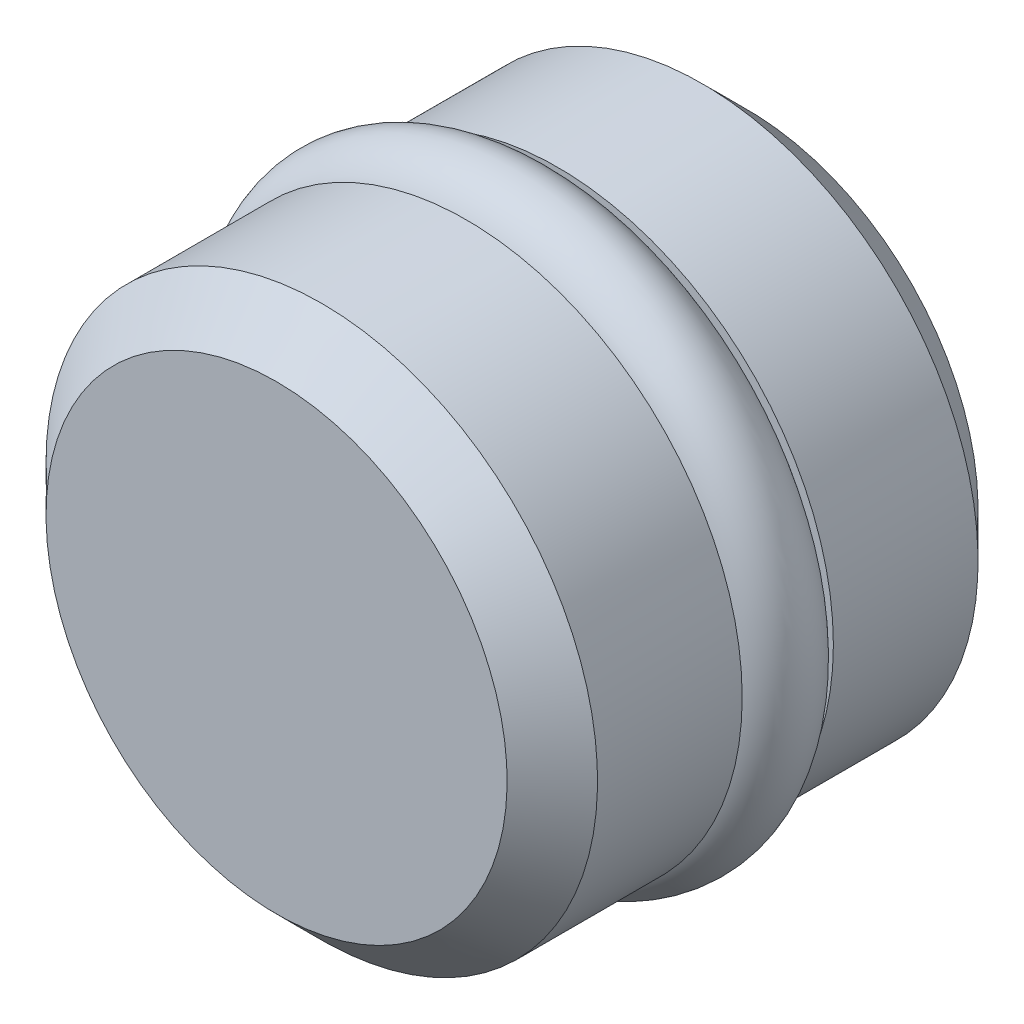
ISO-10303-21;
HEADER;
FILE_DESCRIPTION(('STEP AP214'),'2;1');
FILE_NAME('part.step','',(''),(''),'','','');
FILE_SCHEMA(('AUTOMOTIVE_DESIGN { 1 0 10303 214 1 1 1 1 }'));
ENDSEC;
DATA;
#1=APPLICATION_CONTEXT('core data for automotive mechanical design processes');
#2=APPLICATION_PROTOCOL_DEFINITION('international standard','automotive_design',2000,#1);
#3=PRODUCT_CONTEXT('',#1,'mechanical');
#4=PRODUCT('Part','Part','',(#3));
#5=PRODUCT_RELATED_PRODUCT_CATEGORY('part','',(#4));
#6=PRODUCT_DEFINITION_FORMATION('','',#4);
#7=PRODUCT_DEFINITION_CONTEXT('part definition',#1,'design');
#8=PRODUCT_DEFINITION('design','',#6,#7);
#9=PRODUCT_DEFINITION_SHAPE('','',#8);
#10=(LENGTH_UNIT() NAMED_UNIT(*) SI_UNIT(.MILLI.,.METRE.));
#11=(NAMED_UNIT(*) PLANE_ANGLE_UNIT() SI_UNIT($,.RADIAN.));
#12=(NAMED_UNIT(*) SI_UNIT($,.STERADIAN.) SOLID_ANGLE_UNIT());
#13=UNCERTAINTY_MEASURE_WITH_UNIT(LENGTH_MEASURE(1.E-05),#10,'distance_accuracy_value','');
#14=(GEOMETRIC_REPRESENTATION_CONTEXT(3) GLOBAL_UNCERTAINTY_ASSIGNED_CONTEXT((#13)) GLOBAL_UNIT_ASSIGNED_CONTEXT((#10,
#11,#12)) REPRESENTATION_CONTEXT('',''));
#15=CARTESIAN_POINT('',(0.,0.,0.));
#16=DIRECTION('',(0.,0.,1.));
#17=DIRECTION('',(1.,0.,0.));
#18=AXIS2_PLACEMENT_3D('',#15,#16,#17);
#19=CARTESIAN_POINT('',(0.,0.,3.96875));
#20=DIRECTION('',(0.,0.,-1.));
#21=DIRECTION('',(0.,1.,0.));
#22=AXIS2_PLACEMENT_3D('',#19,#20,#21);
#23=TOROIDAL_SURFACE('',#22,4.24815,0.76835);
#24=CARTESIAN_POINT('',(0.,5.0165,3.96875));
#25=VERTEX_POINT('',#24);
#26=VERTEX_LOOP('',#25);
#27=FACE_BOUND('',#26,.T.);
#28=ADVANCED_FACE('P0_F12',(#27),#23,.T.);
#29=CLOSED_SHELL('',(#28));
#30=MANIFOLD_SOLID_BREP('P0_B1',#29);
#31=CARTESIAN_POINT('',(0.,0.,6.35000000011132));
#32=DIRECTION('',(0.,0.,-1.));
#33=DIRECTION('',(-1.,0.,0.));
#34=AXIS2_PLACEMENT_3D('',#31,#32,#33);
#35=CONICAL_SURFACE('',#34,1.98373999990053,1.02974425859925);
#36=CARTESIAN_POINT('',(0.,1.13686837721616E-10,7.54195124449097));
#37=VERTEX_POINT('',#36);
#38=VERTEX_LOOP('',#37);
#39=FACE_BOUND('',#38,.T.);
#40=CARTESIAN_POINT('',(0.,0.,6.35));
#41=DIRECTION('',(0.,0.,1.));
#42=DIRECTION('',(1.,0.,0.));
#43=AXIS2_PLACEMENT_3D('',#40,#41,#42);
#44=CIRCLE('',#43,1.98374);
#45=CARTESIAN_POINT('',(1.98374,0.,6.35));
#46=VERTEX_POINT('',#45);
#47=EDGE_CURVE('P1_E32',#46,#46,#44,.F.);
#48=ORIENTED_EDGE('',*,*,#47,.T.);
#49=EDGE_LOOP('',(#48));
#50=FACE_BOUND('',#49,.T.);
#51=ADVANCED_FACE('P1_F15',(#39,#50),#35,.F.);
#52=CARTESIAN_POINT('',(0.,0.,0.));
#53=DIRECTION('',(0.,0.,1.));
#54=DIRECTION('',(1.,0.,0.));
#55=AXIS2_PLACEMENT_3D('',#52,#53,#54);
#56=CYLINDRICAL_SURFACE('',#55,1.98374);
#57=ORIENTED_EDGE('',*,*,#47,.F.);
#58=EDGE_LOOP('',(#57));
#59=FACE_BOUND('',#58,.T.);
#60=CARTESIAN_POINT('',(0.,0.,0.));
#61=DIRECTION('',(0.,0.,1.));
#62=DIRECTION('',(1.,0.,0.));
#63=AXIS2_PLACEMENT_3D('',#60,#61,#62);
#64=CIRCLE('',#63,1.98374);
#65=CARTESIAN_POINT('',(1.98374,0.,0.));
#66=VERTEX_POINT('',#65);
#67=EDGE_CURVE('P1_E34',#66,#66,#64,.T.);
#68=ORIENTED_EDGE('',*,*,#67,.F.);
#69=EDGE_LOOP('',(#68));
#70=FACE_BOUND('',#69,.T.);
#71=ADVANCED_FACE('P1_F28',(#59,#70),#56,.F.);
#72=CARTESIAN_POINT('',(0.,0.,0.));
#73=DIRECTION('',(0.,0.,-1.));
#74=DIRECTION('',(-1.,0.,0.));
#75=AXIS2_PLACEMENT_3D('',#72,#73,#74);
#76=PLANE('',#75);
#77=CARTESIAN_POINT('',(0.,0.,-5.6843418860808E-11));
#78=DIRECTION('',(0.,0.,1.));
#79=DIRECTION('',(0.,-1.,0.));
#80=AXIS2_PLACEMENT_3D('',#77,#78,#79);
#81=CIRCLE('',#80,3.88619999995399);
#82=CARTESIAN_POINT('',(0.,-3.88619999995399,-5.68433735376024E-11));
#83=VERTEX_POINT('',#82);
#84=EDGE_CURVE('P1_E38',#83,#83,#81,.T.);
#85=ORIENTED_EDGE('',*,*,#84,.F.);
#86=EDGE_LOOP('',(#85));
#87=FACE_BOUND('',#86,.T.);
#88=ORIENTED_EDGE('',*,*,#67,.T.);
#89=EDGE_LOOP('',(#88));
#90=FACE_BOUND('',#89,.T.);
#91=ADVANCED_FACE('P1_F62',(#87,#90),#76,.T.);
#92=CARTESIAN_POINT('',(0.,0.,0.761999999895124));
#93=DIRECTION('',(0.,0.,1.));
#94=DIRECTION('',(0.,-1.,0.));
#95=AXIS2_PLACEMENT_3D('',#92,#93,#94);
#96=CONICAL_SURFACE('',#95,4.64819999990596,0.785398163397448);
#97=CARTESIAN_POINT('',(0.,0.,0.762));
#98=DIRECTION('',(0.,0.,-1.));
#99=DIRECTION('',(-1.,0.,0.));
#100=AXIS2_PLACEMENT_3D('',#97,#98,#99);
#101=CIRCLE('',#100,4.6482);
#102=CARTESIAN_POINT('',(-4.6482,0.,0.762));
#103=VERTEX_POINT('',#102);
#104=EDGE_CURVE('P1_E42',#103,#103,#101,.F.);
#105=ORIENTED_EDGE('',*,*,#104,.F.);
#106=EDGE_LOOP('',(#105));
#107=FACE_BOUND('',#106,.T.);
#108=ORIENTED_EDGE('',*,*,#84,.T.);
#109=EDGE_LOOP('',(#108));
#110=FACE_BOUND('',#109,.T.);
#111=ADVANCED_FACE('P1_F60',(#107,#110),#96,.T.);
#112=CARTESIAN_POINT('',(0.,0.,7.9375));
#113=DIRECTION('',(0.,0.,-1.));
#114=DIRECTION('',(-1.,0.,0.));
#115=AXIS2_PLACEMENT_3D('',#112,#113,#114);
#116=CYLINDRICAL_SURFACE('',#115,4.6482);
#117=ORIENTED_EDGE('',*,*,#104,.T.);
#118=EDGE_LOOP('',(#117));
#119=FACE_BOUND('',#118,.T.);
#120=CARTESIAN_POINT('',(0.,0.,3.2004));
#121=DIRECTION('',(0.,0.,-1.));
#122=DIRECTION('',(-1.,0.,0.));
#123=AXIS2_PLACEMENT_3D('',#120,#121,#122);
#124=CIRCLE('',#123,4.6482);
#125=CARTESIAN_POINT('',(-4.6482,0.,3.2004));
#126=VERTEX_POINT('',#125);
#127=EDGE_CURVE('P1_E48',#126,#126,#124,.F.);
#128=ORIENTED_EDGE('',*,*,#127,.F.);
#129=EDGE_LOOP('',(#128));
#130=FACE_BOUND('',#129,.T.);
#131=ADVANCED_FACE('P1_F57',(#119,#130),#116,.T.);
#132=CARTESIAN_POINT('',(-3.4671,0.,3.2004));
#133=DIRECTION('',(0.,0.,1.));
#134=DIRECTION('',(1.,0.,0.));
#135=AXIS2_PLACEMENT_3D('',#132,#133,#134);
#136=PLANE('',#135);
#137=ORIENTED_EDGE('',*,*,#127,.T.);
#138=EDGE_LOOP('',(#137));
#139=FACE_BOUND('',#138,.T.);
#140=CARTESIAN_POINT('',(0.,0.,3.2004));
#141=DIRECTION('',(0.,0.,-1.));
#142=DIRECTION('',(-1.,0.,0.));
#143=AXIS2_PLACEMENT_3D('',#140,#141,#142);
#144=CIRCLE('',#143,3.4798);
#145=CARTESIAN_POINT('',(-3.4798,0.,3.2004));
#146=VERTEX_POINT('',#145);
#147=EDGE_CURVE('P1_E35',#146,#146,#144,.T.);
#148=ORIENTED_EDGE('',*,*,#147,.T.);
#149=EDGE_LOOP('',(#148));
#150=FACE_BOUND('',#149,.T.);
#151=ADVANCED_FACE('P1_F69',(#139,#150),#136,.T.);
#152=CARTESIAN_POINT('',(0.,0.,0.));
#153=DIRECTION('',(0.,0.,-1.));
#154=DIRECTION('',(-1.,0.,0.));
#155=AXIS2_PLACEMENT_3D('',#152,#153,#154);
#156=CYLINDRICAL_SURFACE('',#155,3.4798);
#157=ORIENTED_EDGE('',*,*,#147,.F.);
#158=EDGE_LOOP('',(#157));
#159=FACE_BOUND('',#158,.T.);
#160=CARTESIAN_POINT('',(0.,0.,4.7371));
#161=DIRECTION('',(0.,0.,-1.));
#162=DIRECTION('',(-1.,0.,0.));
#163=AXIS2_PLACEMENT_3D('',#160,#161,#162);
#164=CIRCLE('',#163,3.4798);
#165=CARTESIAN_POINT('',(-3.4798,0.,4.7371));
#166=VERTEX_POINT('',#165);
#167=EDGE_CURVE('P1_E18',#166,#166,#164,.F.);
#168=ORIENTED_EDGE('',*,*,#167,.F.);
#169=EDGE_LOOP('',(#168));
#170=FACE_BOUND('',#169,.T.);
#171=ADVANCED_FACE('P1_F29',(#159,#170),#156,.T.);
#172=CARTESIAN_POINT('',(0.,0.,7.9375));
#173=DIRECTION('',(0.,0.,-1.));
#174=DIRECTION('',(-1.,0.,0.));
#175=AXIS2_PLACEMENT_3D('',#172,#173,#174);
#176=PLANE('',#175);
#177=CARTESIAN_POINT('',(0.,0.,7.93749999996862));
#178=DIRECTION('',(0.,0.,-1.));
#179=DIRECTION('',(0.,1.,0.));
#180=AXIS2_PLACEMENT_3D('',#177,#178,#179);
#181=CIRCLE('',#180,3.88620000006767);
#182=CARTESIAN_POINT('',(0.,3.88620000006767,7.93749999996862));
#183=VERTEX_POINT('',#182);
#184=EDGE_CURVE('P1_E10',#183,#183,#181,.T.);
#185=ORIENTED_EDGE('',*,*,#184,.F.);
#186=EDGE_LOOP('',(#185));
#187=FACE_BOUND('',#186,.T.);
#188=ADVANCED_FACE('P1_F79',(#187),#176,.F.);
#189=CARTESIAN_POINT('',(0.,0.,7.17550000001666));
#190=DIRECTION('',(0.,0.,-1.));
#191=DIRECTION('',(0.,1.,0.));
#192=AXIS2_PLACEMENT_3D('',#189,#190,#191);
#193=CONICAL_SURFACE('',#192,4.64820000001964,0.785398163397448);
#194=ORIENTED_EDGE('',*,*,#184,.T.);
#195=EDGE_LOOP('',(#194));
#196=FACE_BOUND('',#195,.T.);
#197=CARTESIAN_POINT('',(0.,0.,7.17550000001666));
#198=DIRECTION('',(0.,0.,-1.));
#199=DIRECTION('',(-1.,0.,0.));
#200=AXIS2_PLACEMENT_3D('',#197,#198,#199);
#201=CIRCLE('',#200,4.64820000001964);
#202=CARTESIAN_POINT('',(-4.64820000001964,0.,7.17550000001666));
#203=VERTEX_POINT('',#202);
#204=EDGE_CURVE('P1_E22',#203,#203,#201,.F.);
#205=ORIENTED_EDGE('',*,*,#204,.T.);
#206=EDGE_LOOP('',(#205));
#207=FACE_BOUND('',#206,.T.);
#208=ADVANCED_FACE('P1_F91',(#196,#207),#193,.T.);
#209=CARTESIAN_POINT('',(0.,0.,7.9375));
#210=DIRECTION('',(0.,0.,-1.));
#211=DIRECTION('',(-1.,0.,0.));
#212=AXIS2_PLACEMENT_3D('',#209,#210,#211);
#213=CYLINDRICAL_SURFACE('',#212,4.6482);
#214=ORIENTED_EDGE('',*,*,#204,.F.);
#215=EDGE_LOOP('',(#214));
#216=FACE_BOUND('',#215,.T.);
#217=CARTESIAN_POINT('',(0.,0.,4.7371));
#218=DIRECTION('',(0.,0.,-1.));
#219=DIRECTION('',(-1.,0.,0.));
#220=AXIS2_PLACEMENT_3D('',#217,#218,#219);
#221=CIRCLE('',#220,4.6482);
#222=CARTESIAN_POINT('',(-4.6482,0.,4.7371));
#223=VERTEX_POINT('',#222);
#224=EDGE_CURVE('P1_E45',#223,#223,#221,.F.);
#225=ORIENTED_EDGE('',*,*,#224,.T.);
#226=EDGE_LOOP('',(#225));
#227=FACE_BOUND('',#226,.T.);
#228=ADVANCED_FACE('P1_F87',(#216,#227),#213,.T.);
#229=CARTESIAN_POINT('',(-4.6482,0.,4.7371));
#230=DIRECTION('',(0.,0.,-1.));
#231=DIRECTION('',(-1.,0.,0.));
#232=AXIS2_PLACEMENT_3D('',#229,#230,#231);
#233=PLANE('',#232);
#234=ORIENTED_EDGE('',*,*,#224,.F.);
#235=EDGE_LOOP('',(#234));
#236=FACE_BOUND('',#235,.T.);
#237=ORIENTED_EDGE('',*,*,#167,.T.);
#238=EDGE_LOOP('',(#237));
#239=FACE_BOUND('',#238,.T.);
#240=ADVANCED_FACE('P1_F84',(#236,#239),#233,.T.);
#241=CLOSED_SHELL('',(#51,#71,#91,#111,#131,#151,#171,#188,#208,#228,#240));
#242=MANIFOLD_SOLID_BREP('P1_B1',#241);
#243=ADVANCED_BREP_SHAPE_REPRESENTATION('',(#18,#30,#242),#14);
#244=SHAPE_DEFINITION_REPRESENTATION(#9,#243);
ENDSEC;
END-ISO-10303-21;
